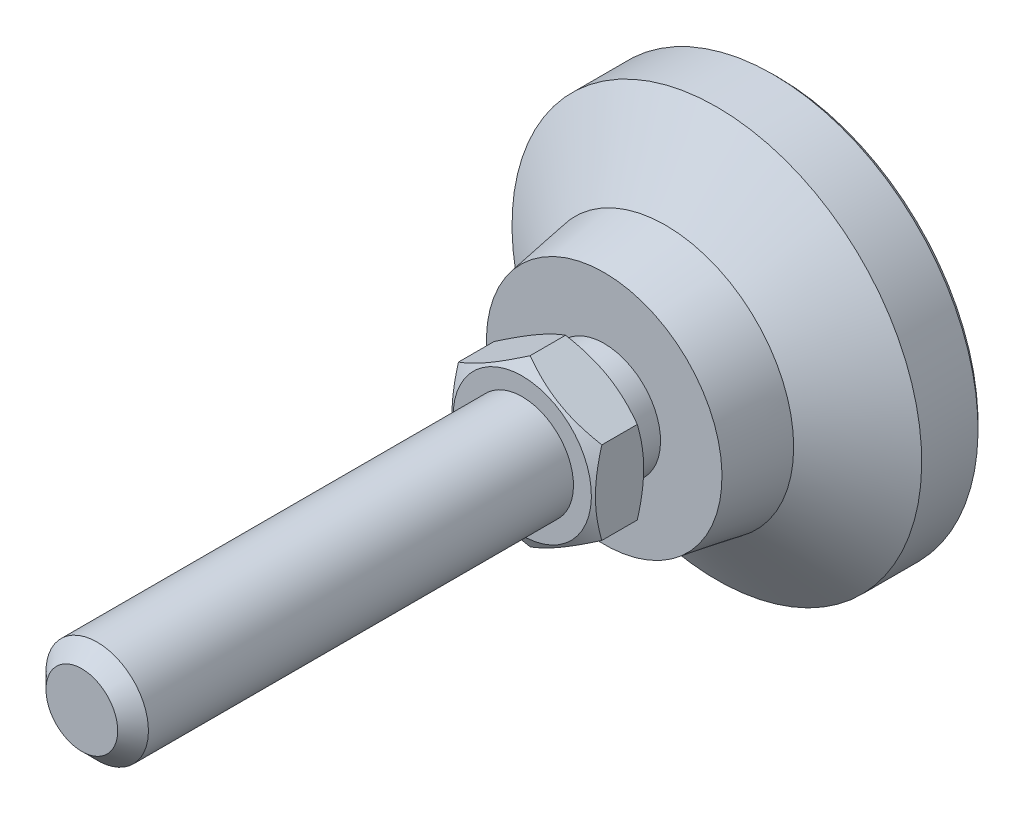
ISO-10303-21;
HEADER;
FILE_DESCRIPTION(('STEP AP214'),'2;1');
FILE_NAME('part.step','',(''),(''),'','','');
FILE_SCHEMA(('AUTOMOTIVE_DESIGN { 1 0 10303 214 1 1 1 1 }'));
ENDSEC;
DATA;
#1=APPLICATION_CONTEXT('core data for automotive mechanical design processes');
#2=APPLICATION_PROTOCOL_DEFINITION('international standard','automotive_design',2000,#1);
#3=PRODUCT_CONTEXT('',#1,'mechanical');
#4=PRODUCT('Part','Part','',(#3));
#5=PRODUCT_RELATED_PRODUCT_CATEGORY('part','',(#4));
#6=PRODUCT_DEFINITION_FORMATION('','',#4);
#7=PRODUCT_DEFINITION_CONTEXT('part definition',#1,'design');
#8=PRODUCT_DEFINITION('design','',#6,#7);
#9=PRODUCT_DEFINITION_SHAPE('','',#8);
#10=(LENGTH_UNIT() NAMED_UNIT(*) SI_UNIT(.MILLI.,.METRE.));
#11=(NAMED_UNIT(*) PLANE_ANGLE_UNIT() SI_UNIT($,.RADIAN.));
#12=(NAMED_UNIT(*) SI_UNIT($,.STERADIAN.) SOLID_ANGLE_UNIT());
#13=UNCERTAINTY_MEASURE_WITH_UNIT(LENGTH_MEASURE(1.E-05),#10,'distance_accuracy_value','');
#14=(GEOMETRIC_REPRESENTATION_CONTEXT(3) GLOBAL_UNCERTAINTY_ASSIGNED_CONTEXT((#13)) GLOBAL_UNIT_ASSIGNED_CONTEXT((#10,
#11,#12)) REPRESENTATION_CONTEXT('',''));
#15=CARTESIAN_POINT('',(0.,0.,0.));
#16=DIRECTION('',(0.,0.,1.));
#17=DIRECTION('',(1.,0.,0.));
#18=AXIS2_PLACEMENT_3D('',#15,#16,#17);
#19=CARTESIAN_POINT('',(-5.49999999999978,0.,20.));
#20=DIRECTION('',(0.,0.,1.));
#21=DIRECTION('',(0.,-1.,0.));
#22=AXIS2_PLACEMENT_3D('',#19,#20,#21);
#23=PLANE('',#22);
#24=CARTESIAN_POINT('',(0.,0.,20.));
#25=DIRECTION('',(0.,0.,-1.));
#26=DIRECTION('',(0.,1.,0.));
#27=AXIS2_PLACEMENT_3D('',#24,#25,#26);
#28=CIRCLE('',#27,5.49999999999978);
#29=CARTESIAN_POINT('',(0.,5.49999999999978,20.));
#30=VERTEX_POINT('',#29);
#31=EDGE_CURVE('E99',#30,#30,#28,.T.);
#32=ORIENTED_EDGE('',*,*,#31,.F.);
#33=EDGE_LOOP('',(#32));
#34=FACE_BOUND('',#33,.T.);
#35=CARTESIAN_POINT('',(0.,0.,20.));
#36=DIRECTION('',(0.,0.,-1.));
#37=DIRECTION('',(0.,1.,0.));
#38=AXIS2_PLACEMENT_3D('',#35,#36,#37);
#39=CIRCLE('',#38,6.75);
#40=CARTESIAN_POINT('',(0.,6.75,20.));
#41=VERTEX_POINT('',#40);
#42=EDGE_CURVE('E79',#41,#41,#39,.T.);
#43=ORIENTED_EDGE('',*,*,#42,.T.);
#44=EDGE_LOOP('',(#43));
#45=FACE_BOUND('',#44,.T.);
#46=ADVANCED_FACE('F14',(#34,#45),#23,.F.);
#47=CARTESIAN_POINT('',(0.,0.,-1.00000000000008));
#48=DIRECTION('',(0.,0.,-1.));
#49=DIRECTION('',(0.,1.,0.));
#50=AXIS2_PLACEMENT_3D('',#47,#48,#49);
#51=CYLINDRICAL_SURFACE('',#50,20.);
#52=CARTESIAN_POINT('',(0.,0.,0.500000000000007));
#53=DIRECTION('',(0.,0.,-1.));
#54=DIRECTION('',(0.,1.,0.));
#55=AXIS2_PLACEMENT_3D('',#52,#53,#54);
#56=CIRCLE('',#55,20.);
#57=CARTESIAN_POINT('',(0.,20.,0.500000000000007));
#58=VERTEX_POINT('',#57);
#59=EDGE_CURVE('E117',#58,#58,#56,.F.);
#60=ORIENTED_EDGE('',*,*,#59,.T.);
#61=EDGE_LOOP('',(#60));
#62=FACE_BOUND('',#61,.T.);
#63=CARTESIAN_POINT('',(0.,0.,6.));
#64=DIRECTION('',(0.,0.,-1.));
#65=DIRECTION('',(0.,1.,0.));
#66=AXIS2_PLACEMENT_3D('',#63,#64,#65);
#67=CIRCLE('',#66,20.);
#68=CARTESIAN_POINT('',(0.,20.,6.));
#69=VERTEX_POINT('',#68);
#70=EDGE_CURVE('E111',#69,#69,#67,.T.);
#71=ORIENTED_EDGE('',*,*,#70,.T.);
#72=EDGE_LOOP('',(#71));
#73=FACE_BOUND('',#72,.T.);
#74=ADVANCED_FACE('F238',(#62,#73),#51,.T.);
#75=CARTESIAN_POINT('',(0.,0.,11.));
#76=DIRECTION('',(0.,0.,-1.));
#77=DIRECTION('',(0.,1.,0.));
#78=AXIS2_PLACEMENT_3D('',#75,#76,#77);
#79=CONICAL_SURFACE('',#78,12.5,0.98279372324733);
#80=ORIENTED_EDGE('',*,*,#70,.F.);
#81=EDGE_LOOP('',(#80));
#82=FACE_BOUND('',#81,.T.);
#83=CARTESIAN_POINT('',(0.,0.,11.));
#84=DIRECTION('',(0.,0.,-1.));
#85=DIRECTION('',(0.,1.,0.));
#86=AXIS2_PLACEMENT_3D('',#83,#84,#85);
#87=CIRCLE('',#86,12.5);
#88=CARTESIAN_POINT('',(0.,12.5,11.));
#89=VERTEX_POINT('',#88);
#90=EDGE_CURVE('E108',#89,#89,#87,.T.);
#91=ORIENTED_EDGE('',*,*,#90,.T.);
#92=EDGE_LOOP('',(#91));
#93=FACE_BOUND('',#92,.T.);
#94=ADVANCED_FACE('F245',(#82,#93),#79,.T.);
#95=CARTESIAN_POINT('',(0.,0.,17.));
#96=DIRECTION('',(0.,0.,-1.));
#97=DIRECTION('',(0.,1.,0.));
#98=AXIS2_PLACEMENT_3D('',#95,#96,#97);
#99=CONICAL_SURFACE('',#98,11.5,0.165148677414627);
#100=ORIENTED_EDGE('',*,*,#90,.F.);
#101=EDGE_LOOP('',(#100));
#102=FACE_BOUND('',#101,.T.);
#103=CARTESIAN_POINT('',(0.,0.,17.));
#104=DIRECTION('',(0.,0.,-1.));
#105=DIRECTION('',(0.,1.,0.));
#106=AXIS2_PLACEMENT_3D('',#103,#104,#105);
#107=CIRCLE('',#106,11.5);
#108=CARTESIAN_POINT('',(0.,11.5,17.));
#109=VERTEX_POINT('',#108);
#110=EDGE_CURVE('E105',#109,#109,#107,.T.);
#111=ORIENTED_EDGE('',*,*,#110,.T.);
#112=EDGE_LOOP('',(#111));
#113=FACE_BOUND('',#112,.T.);
#114=ADVANCED_FACE('F258',(#102,#113),#99,.T.);
#115=CARTESIAN_POINT('',(-11.5,0.,17.));
#116=DIRECTION('',(0.,0.,-1.));
#117=DIRECTION('',(0.,1.,0.));
#118=AXIS2_PLACEMENT_3D('',#115,#116,#117);
#119=PLANE('',#118);
#120=ORIENTED_EDGE('',*,*,#110,.F.);
#121=EDGE_LOOP('',(#120));
#122=FACE_BOUND('',#121,.T.);
#123=CARTESIAN_POINT('',(0.,0.,17.));
#124=DIRECTION('',(0.,0.,-1.));
#125=DIRECTION('',(0.,1.,0.));
#126=AXIS2_PLACEMENT_3D('',#123,#124,#125);
#127=CIRCLE('',#126,5.49999999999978);
#128=CARTESIAN_POINT('',(0.,5.49999999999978,17.));
#129=VERTEX_POINT('',#128);
#130=EDGE_CURVE('E102',#129,#129,#127,.T.);
#131=ORIENTED_EDGE('',*,*,#130,.T.);
#132=EDGE_LOOP('',(#131));
#133=FACE_BOUND('',#132,.T.);
#134=ADVANCED_FACE('F254',(#122,#133),#119,.F.);
#135=CARTESIAN_POINT('',(0.,0.,-1.00000000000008));
#136=DIRECTION('',(0.,0.,-1.));
#137=DIRECTION('',(0.,1.,0.));
#138=AXIS2_PLACEMENT_3D('',#135,#136,#137);
#139=CYLINDRICAL_SURFACE('',#138,5.49999999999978);
#140=ORIENTED_EDGE('',*,*,#130,.F.);
#141=EDGE_LOOP('',(#140));
#142=FACE_BOUND('',#141,.T.);
#143=ORIENTED_EDGE('',*,*,#31,.T.);
#144=EDGE_LOOP('',(#143));
#145=FACE_BOUND('',#144,.T.);
#146=ADVANCED_FACE('F251',(#142,#145),#139,.T.);
#147=CARTESIAN_POINT('',(0.,0.,0.));
#148=DIRECTION('',(0.,0.,-1.));
#149=DIRECTION('',(0.,1.,0.));
#150=AXIS2_PLACEMENT_3D('',#147,#148,#149);
#151=PLANE('',#150);
#152=CARTESIAN_POINT('',(0.,0.,0.));
#153=DIRECTION('',(0.,0.,-1.));
#154=DIRECTION('',(0.,1.,0.));
#155=AXIS2_PLACEMENT_3D('',#152,#153,#154);
#156=CIRCLE('',#155,19.5);
#157=CARTESIAN_POINT('',(0.,19.5,0.));
#158=VERTEX_POINT('',#157);
#159=EDGE_CURVE('E114',#158,#158,#156,.T.);
#160=ORIENTED_EDGE('',*,*,#159,.T.);
#161=EDGE_LOOP('',(#160));
#162=FACE_BOUND('',#161,.T.);
#163=ADVANCED_FACE('F197',(#162),#151,.T.);
#164=CARTESIAN_POINT('',(0.,0.,0.));
#165=DIRECTION('',(0.,0.,1.));
#166=DIRECTION('',(0.,-1.,0.));
#167=AXIS2_PLACEMENT_3D('',#164,#165,#166);
#168=CONICAL_SURFACE('',#167,19.5,0.785398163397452);
#169=ORIENTED_EDGE('',*,*,#59,.F.);
#170=EDGE_LOOP('',(#169));
#171=FACE_BOUND('',#170,.T.);
#172=ORIENTED_EDGE('',*,*,#159,.F.);
#173=EDGE_LOOP('',(#172));
#174=FACE_BOUND('',#173,.T.);
#175=ADVANCED_FACE('F16',(#171,#174),#168,.T.);
#176=CARTESIAN_POINT('',(0.,0.,20.));
#177=DIRECTION('',(0.,0.,1.));
#178=DIRECTION('',(0.,-1.,0.));
#179=AXIS2_PLACEMENT_3D('',#176,#177,#178);
#180=CONICAL_SURFACE('',#179,6.75,1.0471975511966);
#181=CARTESIAN_POINT('',(-7.,10.8286773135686,23.5473523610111));
#182=CARTESIAN_POINT('',(-7.,10.5231670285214,23.3992618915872));
#183=CARTESIAN_POINT('',(-7.,10.2169525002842,23.2525992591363));
#184=CARTESIAN_POINT('',(-7.,9.60274032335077,22.9629332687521));
#185=CARTESIAN_POINT('',(-7.,9.29474240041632,22.8199304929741));
#186=CARTESIAN_POINT('',(-7.,8.67498885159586,22.5376625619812));
#187=CARTESIAN_POINT('',(-7.,8.36322187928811,22.39842223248));
#188=CARTESIAN_POINT('',(-7.,7.73719876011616,22.1256761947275));
#189=CARTESIAN_POINT('',(-7.,7.42294273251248,21.9921702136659));
#190=CARTESIAN_POINT('',(-7.,6.78140506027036,21.7282793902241));
#191=CARTESIAN_POINT('',(-7.,6.45402670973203,21.5981283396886));
#192=CARTESIAN_POINT('',(-7.,5.7954306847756,21.3477424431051));
#193=CARTESIAN_POINT('',(-7.,5.46421258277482,21.2275087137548));
#194=CARTESIAN_POINT('',(-7.,4.79803485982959,21.0001341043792));
#195=CARTESIAN_POINT('',(-7.,4.46308446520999,20.8929664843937));
#196=CARTESIAN_POINT('',(-7.,3.78839128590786,20.6951793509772));
#197=CARTESIAN_POINT('',(-7.,3.44865005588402,20.6045545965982));
#198=CARTESIAN_POINT('',(-7.,2.76600511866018,20.444706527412));
#199=CARTESIAN_POINT('',(-7.,2.42312908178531,20.3753682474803));
#200=CARTESIAN_POINT('',(-7.,1.90571452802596,20.2903413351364));
#201=CARTESIAN_POINT('',(-7.,1.73271335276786,20.2651612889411));
#202=CARTESIAN_POINT('',(-7.,1.38586036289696,20.2216225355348));
#203=CARTESIAN_POINT('',(-7.,1.21200863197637,20.2032631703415));
#204=CARTESIAN_POINT('',(-7.,0.865946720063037,20.1739604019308));
#205=CARTESIAN_POINT('',(-7.,0.693744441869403,20.1629240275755));
#206=CARTESIAN_POINT('',(-7.,0.349027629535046,20.1481413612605));
#207=CARTESIAN_POINT('',(-7.,0.176513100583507,20.1443949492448));
#208=CARTESIAN_POINT('',(-7.,-0.168520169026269,20.1442815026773));
#209=CARTESIAN_POINT('',(-7.,-0.341038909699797,20.1479145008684));
#210=CARTESIAN_POINT('',(-7.,-0.685770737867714,20.1624715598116));
#211=CARTESIAN_POINT('',(-7.,-0.857983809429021,20.1733959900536));
#212=CARTESIAN_POINT('',(-7.,-1.27268968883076,20.2082522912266));
#213=CARTESIAN_POINT('',(-7.,-1.51489399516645,20.2356895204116));
#214=CARTESIAN_POINT('',(-7.,-1.99747569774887,20.3034833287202));
#215=CARTESIAN_POINT('',(-7.,-2.23785283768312,20.3438416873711));
#216=CARTESIAN_POINT('',(-7.,-2.95598505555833,20.4821559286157));
#217=CARTESIAN_POINT('',(-7.,-3.43046706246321,20.5973249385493));
#218=CARTESIAN_POINT('',(-7.,-4.1399103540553,20.7966719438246));
#219=CARTESIAN_POINT('',(-7.,-4.37856066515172,20.8684732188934));
#220=CARTESIAN_POINT('',(-7.,-4.85354269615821,21.0194420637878));
#221=CARTESIAN_POINT('',(-7.,-5.08987440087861,21.0986096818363));
#222=CARTESIAN_POINT('',(-7.,-5.56029534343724,21.263048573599));
#223=CARTESIAN_POINT('',(-7.,-5.79438531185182,21.3483177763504));
#224=CARTESIAN_POINT('',(-7.,-6.26063186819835,21.5239656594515));
#225=CARTESIAN_POINT('',(-7.,-6.49278847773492,21.6143442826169));
#226=CARTESIAN_POINT('',(-7.,-7.03644198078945,21.8317803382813));
#227=CARTESIAN_POINT('',(-7.,-7.34723540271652,21.9605932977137));
#228=CARTESIAN_POINT('',(-7.,-7.9662167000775,22.2243518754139));
#229=CARTESIAN_POINT('',(-7.,-8.27440442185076,22.359297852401));
#230=CARTESIAN_POINT('',(-7.,-8.88864807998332,22.6341025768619));
#231=CARTESIAN_POINT('',(-7.,-9.19470358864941,22.7739622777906));
#232=CARTESIAN_POINT('',(-7.,-9.80498694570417,23.05762087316));
#233=CARTESIAN_POINT('',(-7.,-10.1092147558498,23.2014198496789));
#234=CARTESIAN_POINT('',(-7.,-10.7164491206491,23.4923727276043));
#235=CARTESIAN_POINT('',(-7.,-11.0194540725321,23.6395299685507));
#236=CARTESIAN_POINT('',(-7.,-11.6241664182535,23.9364891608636));
#237=CARTESIAN_POINT('',(-7.,-11.9258738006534,24.0862911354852));
#238=CARTESIAN_POINT('',(-7.,-12.8292793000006,24.5389279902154));
#239=CARTESIAN_POINT('',(-7.,-13.4293394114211,24.8450317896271));
#240=CARTESIAN_POINT('',(-7.,-14.576764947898,25.4378090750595));
#241=CARTESIAN_POINT('',(-7.,-15.1243832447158,25.7239952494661));
#242=CARTESIAN_POINT('',(-7.,-16.2175820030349,26.300275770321));
#243=CARTESIAN_POINT('',(-7.,-16.7631623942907,26.5903702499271));
#244=CARTESIAN_POINT('',(-7.,-17.8514037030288,27.1728297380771));
#245=CARTESIAN_POINT('',(-7.,-18.3940684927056,27.4651875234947));
#246=CARTESIAN_POINT('',(-7.,-19.4780927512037,28.0522447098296));
#247=CARTESIAN_POINT('',(-7.,-20.0194522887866,28.3469439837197));
#248=CARTESIAN_POINT('',(-7.,-20.56033024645,28.6425185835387));
#249=B_SPLINE_CURVE_WITH_KNOTS('',3,(#181,#182,#183,#184,#185,#186,#187,#188,#189,#190,#191,
#192,#193,#194,#195,#196,#197,#198,#199,#200,#201,#202,#203,#204,#205,#206,#207,#208,#209,#210,
#211,#212,#213,#214,#215,#216,#217,#218,#219,#220,#221,#222,#223,#224,#225,#226,#227,#228,#229,
#230,#231,#232,#233,#234,#235,#236,#237,#238,#239,#240,#241,#242,#243,#244,#245,#246,#247,#248),
.UNSPECIFIED.,.F.,.F.,(4,2,2,2,2,2,2,2,2,2,2,2,2,2,2,2,2,2,2,2,2,2,2,2,2,2,2,2,2,2,2,2,2,4),(0.,
1.01854381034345,2.03724864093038,3.0615454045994,4.08579338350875,5.14257124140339,
6.1994679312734,7.25416400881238,8.30852536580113,9.35708780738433,9.8814465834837,
10.4057547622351,10.9232721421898,11.4407809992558,11.9582921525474,12.4758295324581,
13.2066762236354,13.9376236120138,15.4003400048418,16.1479314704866,16.8955278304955,
17.6428716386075,18.3902070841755,19.3994095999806,20.4086712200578,21.4181297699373,
22.427609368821,23.4381407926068,24.4486811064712,26.4694997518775,28.3231535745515,
30.1768707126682,32.0260869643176,33.8752035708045),.UNSPECIFIED.);
#250=CARTESIAN_POINT('',(-7.,4.04145188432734,20.7695523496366));
#251=VERTEX_POINT('',#250);
#252=CARTESIAN_POINT('',(-7.,-4.04145188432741,20.7695523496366));
#253=VERTEX_POINT('',#252);
#254=EDGE_CURVE('E85',#251,#253,#249,.T.);
#255=ORIENTED_EDGE('',*,*,#254,.F.);
#256=CARTESIAN_POINT('',(0.00020000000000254,8.08301923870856,20.7696190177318));
#257=CARTESIAN_POINT('',(-0.153667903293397,7.99418356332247,20.7183374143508));
#258=CARTESIAN_POINT('',(-0.308109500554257,7.90501666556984,20.669383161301));
#259=CARTESIAN_POINT('',(-0.618246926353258,7.725958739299,20.5767703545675));
#260=CARTESIAN_POINT('',(-0.773943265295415,7.63606741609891,20.5331140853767));
#261=CARTESIAN_POINT('',(-1.24352516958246,7.36495417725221,20.4109491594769));
#262=CARTESIAN_POINT('',(-1.5592643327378,7.18266208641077,20.3414631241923));
#263=CARTESIAN_POINT('',(-2.03176224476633,6.90986528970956,20.2599825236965));
#264=CARTESIAN_POINT('',(-2.18710922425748,6.82017566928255,20.2367710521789));
#265=CARTESIAN_POINT('',(-2.49850511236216,6.64039116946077,20.1978487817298));
#266=CARTESIAN_POINT('',(-2.6545539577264,6.55029632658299,20.1821373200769));
#267=CARTESIAN_POINT('',(-2.96692267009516,6.36995016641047,20.1586154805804));
#268=CARTESIAN_POINT('',(-3.12324202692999,6.27969914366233,20.1507961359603));
#269=CARTESIAN_POINT('',(-3.43601650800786,6.09911871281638,20.1432178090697));
#270=CARTESIAN_POINT('',(-3.59247162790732,6.00878930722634,20.1434585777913));
#271=CARTESIAN_POINT('',(-4.02110687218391,5.76131663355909,20.1551972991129));
#272=CARTESIAN_POINT('',(-4.29314668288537,5.6042543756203,20.1749033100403));
#273=CARTESIAN_POINT('',(-4.83541944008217,5.29117305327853,20.2373910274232));
#274=CARTESIAN_POINT('',(-5.10565047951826,5.13515508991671,20.2801940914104));
#275=CARTESIAN_POINT('',(-5.64901454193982,4.82144370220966,20.3871892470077));
#276=CARTESIAN_POINT('',(-5.92207900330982,4.66378986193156,20.4518346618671));
#277=CARTESIAN_POINT('',(-6.46413578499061,4.35083323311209,20.5985536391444));
#278=CARTESIAN_POINT('',(-6.73313504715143,4.19552643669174,20.6805927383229));
#279=CARTESIAN_POINT('',(-7.0002,4.0413364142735,20.7696190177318));
#280=B_SPLINE_CURVE_WITH_KNOTS('',3,(#256,#257,#258,#259,#260,#261,#262,#263,#264,#265,#266,
#267,#268,#269,#270,#271,#272,#273,#274,#275,#276,#277,#278,#279),.UNSPECIFIED.,.F.,.F.,(4,2,2,
2,2,2,2,2,2,2,2,4),(0.,0.554727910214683,1.10969417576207,2.22193274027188,2.76443041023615,
3.30688013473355,3.84871284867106,4.39052882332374,5.33376515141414,6.27787517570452,
7.24292418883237,8.20607866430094),.UNSPECIFIED.);
#281=CARTESIAN_POINT('',(0.,8.08290376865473,20.7695523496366));
#282=VERTEX_POINT('',#281);
#283=EDGE_CURVE('E205',#282,#251,#280,.T.);
#284=ORIENTED_EDGE('',*,*,#283,.F.);
#285=CARTESIAN_POINT('',(7.0002,4.04133641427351,20.7696190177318));
#286=CARTESIAN_POINT('',(6.8463320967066,4.1301720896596,20.7183374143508));
#287=CARTESIAN_POINT('',(6.69189049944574,4.21933898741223,20.669383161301));
#288=CARTESIAN_POINT('',(6.38175307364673,4.39839691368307,20.5767703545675));
#289=CARTESIAN_POINT('',(6.22605673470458,4.48828823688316,20.5331140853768));
#290=CARTESIAN_POINT('',(5.75647483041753,4.75940147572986,20.4109491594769));
#291=CARTESIAN_POINT('',(5.44073566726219,4.9416935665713,20.3414631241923));
#292=CARTESIAN_POINT('',(4.96823775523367,5.21449036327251,20.2599825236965));
#293=CARTESIAN_POINT('',(4.81289077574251,5.30417998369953,20.2367710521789));
#294=CARTESIAN_POINT('',(4.50149488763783,5.4839644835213,20.1978487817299));
#295=CARTESIAN_POINT('',(4.34544604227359,5.57405932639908,20.1821373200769));
#296=CARTESIAN_POINT('',(4.03307732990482,5.7544054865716,20.1586154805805));
#297=CARTESIAN_POINT('',(3.87675797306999,5.84465650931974,20.1507961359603));
#298=CARTESIAN_POINT('',(3.56398349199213,6.02523694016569,20.1432178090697));
#299=CARTESIAN_POINT('',(3.40752837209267,6.11556634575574,20.1434585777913));
#300=CARTESIAN_POINT('',(2.97889312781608,6.36303901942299,20.1551972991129));
#301=CARTESIAN_POINT('',(2.70685331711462,6.52010127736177,20.1749033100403));
#302=CARTESIAN_POINT('',(2.16458055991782,6.83318259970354,20.2373910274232));
#303=CARTESIAN_POINT('',(1.89434952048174,6.98920056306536,20.2801940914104));
#304=CARTESIAN_POINT('',(1.35098545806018,7.30291195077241,20.3871892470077));
#305=CARTESIAN_POINT('',(1.07792099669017,7.46056579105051,20.4518346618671));
#306=CARTESIAN_POINT('',(0.535864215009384,7.77352241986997,20.5985536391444));
#307=CARTESIAN_POINT('',(0.266864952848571,7.92882921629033,20.6805927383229));
#308=CARTESIAN_POINT('',(-0.000199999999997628,8.08301923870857,20.7696190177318));
#309=B_SPLINE_CURVE_WITH_KNOTS('',3,(#285,#286,#287,#288,#289,#290,#291,#292,#293,#294,#295,
#296,#297,#298,#299,#300,#301,#302,#303,#304,#305,#306,#307,#308),.UNSPECIFIED.,.F.,.F.,(4,2,2,
2,2,2,2,2,2,2,2,4),(0.,0.554727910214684,1.10969417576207,2.22193274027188,2.76443041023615,
3.30688013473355,3.84871284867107,4.39052882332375,5.33376515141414,6.27787517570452,
7.24292418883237,8.20607866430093),.UNSPECIFIED.);
#310=CARTESIAN_POINT('',(7.,4.04145188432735,20.7695523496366));
#311=VERTEX_POINT('',#310);
#312=EDGE_CURVE('E212',#311,#282,#309,.T.);
#313=ORIENTED_EDGE('',*,*,#312,.F.);
#314=CARTESIAN_POINT('',(7.,10.8286773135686,23.5473523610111));
#315=CARTESIAN_POINT('',(7.,10.5231670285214,23.3992618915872));
#316=CARTESIAN_POINT('',(7.,10.2169525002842,23.2525992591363));
#317=CARTESIAN_POINT('',(7.,9.60274032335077,22.9629332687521));
#318=CARTESIAN_POINT('',(7.,9.29474240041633,22.8199304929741));
#319=CARTESIAN_POINT('',(7.,8.67498885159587,22.5376625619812));
#320=CARTESIAN_POINT('',(7.,8.36322187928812,22.3984222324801));
#321=CARTESIAN_POINT('',(7.,7.73719876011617,22.1256761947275));
#322=CARTESIAN_POINT('',(7.,7.42294273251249,21.9921702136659));
#323=CARTESIAN_POINT('',(7.,6.78140506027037,21.7282793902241));
#324=CARTESIAN_POINT('',(7.,6.45402670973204,21.5981283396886));
#325=CARTESIAN_POINT('',(7.,5.7954306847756,21.3477424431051));
#326=CARTESIAN_POINT('',(7.,5.46421258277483,21.2275087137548));
#327=CARTESIAN_POINT('',(7.,4.7980348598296,21.0001341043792));
#328=CARTESIAN_POINT('',(7.,4.46308446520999,20.8929664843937));
#329=CARTESIAN_POINT('',(7.,3.78839128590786,20.6951793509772));
#330=CARTESIAN_POINT('',(7.,3.44865005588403,20.6045545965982));
#331=CARTESIAN_POINT('',(7.,2.76600511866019,20.444706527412));
#332=CARTESIAN_POINT('',(7.,2.42312908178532,20.3753682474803));
#333=CARTESIAN_POINT('',(7.,1.90571452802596,20.2903413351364));
#334=CARTESIAN_POINT('',(7.,1.73271335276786,20.2651612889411));
#335=CARTESIAN_POINT('',(7.,1.38586036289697,20.2216225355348));
#336=CARTESIAN_POINT('',(7.,1.21200863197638,20.2032631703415));
#337=CARTESIAN_POINT('',(7.,0.865946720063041,20.1739604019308));
#338=CARTESIAN_POINT('',(7.,0.693744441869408,20.1629240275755));
#339=CARTESIAN_POINT('',(7.,0.34902762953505,20.1481413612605));
#340=CARTESIAN_POINT('',(7.,0.176513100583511,20.1443949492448));
#341=CARTESIAN_POINT('',(7.,-0.168520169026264,20.1442815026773));
#342=CARTESIAN_POINT('',(7.,-0.341038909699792,20.1479145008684));
#343=CARTESIAN_POINT('',(7.,-0.68577073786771,20.1624715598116));
#344=CARTESIAN_POINT('',(7.,-0.857983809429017,20.1733959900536));
#345=CARTESIAN_POINT('',(7.,-1.27268968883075,20.2082522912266));
#346=CARTESIAN_POINT('',(7.,-1.51489399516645,20.2356895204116));
#347=CARTESIAN_POINT('',(7.,-1.99747569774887,20.3034833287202));
#348=CARTESIAN_POINT('',(7.,-2.23785283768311,20.3438416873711));
#349=CARTESIAN_POINT('',(7.,-2.95598505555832,20.4821559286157));
#350=CARTESIAN_POINT('',(7.,-3.43046706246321,20.5973249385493));
#351=CARTESIAN_POINT('',(7.,-4.13991035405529,20.7966719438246));
#352=CARTESIAN_POINT('',(7.,-4.37856066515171,20.8684732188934));
#353=CARTESIAN_POINT('',(7.,-4.85354269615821,21.0194420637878));
#354=CARTESIAN_POINT('',(7.,-5.0898744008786,21.0986096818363));
#355=CARTESIAN_POINT('',(7.,-5.56029534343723,21.263048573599));
#356=CARTESIAN_POINT('',(7.,-5.79438531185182,21.3483177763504));
#357=CARTESIAN_POINT('',(7.,-6.26063186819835,21.5239656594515));
#358=CARTESIAN_POINT('',(7.,-6.4927884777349,21.6143442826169));
#359=CARTESIAN_POINT('',(7.,-7.03644198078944,21.8317803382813));
#360=CARTESIAN_POINT('',(7.,-7.34723540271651,21.9605932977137));
#361=CARTESIAN_POINT('',(7.,-7.96621670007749,22.2243518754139));
#362=CARTESIAN_POINT('',(7.,-8.27440442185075,22.359297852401));
#363=CARTESIAN_POINT('',(7.,-8.88864807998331,22.6341025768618));
#364=CARTESIAN_POINT('',(7.,-9.1947035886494,22.7739622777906));
#365=CARTESIAN_POINT('',(7.,-9.80498694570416,23.05762087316));
#366=CARTESIAN_POINT('',(7.,-10.1092147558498,23.2014198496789));
#367=CARTESIAN_POINT('',(7.,-10.7164491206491,23.4923727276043));
#368=CARTESIAN_POINT('',(7.,-11.0194540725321,23.6395299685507));
#369=CARTESIAN_POINT('',(7.,-11.6241664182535,23.9364891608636));
#370=CARTESIAN_POINT('',(7.,-11.9258738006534,24.0862911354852));
#371=CARTESIAN_POINT('',(7.,-12.8292793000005,24.5389279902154));
#372=CARTESIAN_POINT('',(7.,-13.4293394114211,24.8450317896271));
#373=CARTESIAN_POINT('',(7.,-14.576764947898,25.4378090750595));
#374=CARTESIAN_POINT('',(7.,-15.1243832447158,25.7239952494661));
#375=CARTESIAN_POINT('',(7.,-16.2175820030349,26.300275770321));
#376=CARTESIAN_POINT('',(7.,-16.7631623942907,26.5903702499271));
#377=CARTESIAN_POINT('',(7.,-17.8514037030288,27.1728297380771));
#378=CARTESIAN_POINT('',(7.,-18.3940684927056,27.4651875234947));
#379=CARTESIAN_POINT('',(7.,-19.4780927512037,28.0522447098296));
#380=CARTESIAN_POINT('',(7.,-20.0194522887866,28.3469439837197));
#381=CARTESIAN_POINT('',(7.,-20.56033024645,28.6425185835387));
#382=B_SPLINE_CURVE_WITH_KNOTS('',3,(#314,#315,#316,#317,#318,#319,#320,#321,#322,#323,#324,
#325,#326,#327,#328,#329,#330,#331,#332,#333,#334,#335,#336,#337,#338,#339,#340,#341,#342,#343,
#344,#345,#346,#347,#348,#349,#350,#351,#352,#353,#354,#355,#356,#357,#358,#359,#360,#361,#362,
#363,#364,#365,#366,#367,#368,#369,#370,#371,#372,#373,#374,#375,#376,#377,#378,#379,#380,#381),
.UNSPECIFIED.,.F.,.F.,(4,2,2,2,2,2,2,2,2,2,2,2,2,2,2,2,2,2,2,2,2,2,2,2,2,2,2,2,2,2,2,2,2,4),(0.,
1.01854381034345,2.03724864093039,3.0615454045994,4.08579338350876,5.1425712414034,
6.19946793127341,7.25416400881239,8.30852536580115,9.35708780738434,9.88144658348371,
10.4057547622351,10.9232721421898,11.4407809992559,11.9582921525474,12.4758295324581,
13.2066762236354,13.9376236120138,15.4003400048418,16.1479314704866,16.8955278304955,
17.6428716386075,18.3902070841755,19.3994095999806,20.4086712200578,21.4181297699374,
22.427609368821,23.4381407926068,24.4486811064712,26.4694997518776,28.3231535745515,
30.1768707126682,32.0260869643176,33.8752035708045),.UNSPECIFIED.);
#383=CARTESIAN_POINT('',(7.,-4.04145188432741,20.7695523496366));
#384=VERTEX_POINT('',#383);
#385=EDGE_CURVE('E35',#384,#311,#382,.F.);
#386=ORIENTED_EDGE('',*,*,#385,.F.);
#387=CARTESIAN_POINT('',(-0.000199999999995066,-8.08301923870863,20.7696190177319));
#388=CARTESIAN_POINT('',(0.153667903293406,-7.99418356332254,20.7183374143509));
#389=CARTESIAN_POINT('',(0.308109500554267,-7.90501666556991,20.669383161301));
#390=CARTESIAN_POINT('',(0.618246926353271,-7.72595873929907,20.5767703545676));
#391=CARTESIAN_POINT('',(0.773943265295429,-7.63606741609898,20.5331140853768));
#392=CARTESIAN_POINT('',(1.24352516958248,-7.36495417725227,20.4109491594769));
#393=CARTESIAN_POINT('',(1.55926433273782,-7.18266208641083,20.3414631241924));
#394=CARTESIAN_POINT('',(2.03176224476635,-6.90986528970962,20.2599825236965));
#395=CARTESIAN_POINT('',(2.18710922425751,-6.82017566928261,20.2367710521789));
#396=CARTESIAN_POINT('',(2.49850511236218,-6.64039116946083,20.1978487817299));
#397=CARTESIAN_POINT('',(2.65455395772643,-6.55029632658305,20.1821373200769));
#398=CARTESIAN_POINT('',(2.9669226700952,-6.36995016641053,20.1586154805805));
#399=CARTESIAN_POINT('',(3.12324202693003,-6.27969914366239,20.1507961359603));
#400=CARTESIAN_POINT('',(3.43601650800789,-6.09911871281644,20.1432178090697));
#401=CARTESIAN_POINT('',(3.59247162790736,-6.00878930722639,20.1434585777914));
#402=CARTESIAN_POINT('',(4.02110687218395,-5.76131663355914,20.1551972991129));
#403=CARTESIAN_POINT('',(4.29314668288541,-5.60425437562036,20.1749033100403));
#404=CARTESIAN_POINT('',(4.8354194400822,-5.29117305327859,20.2373910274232));
#405=CARTESIAN_POINT('',(5.10565047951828,-5.13515508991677,20.2801940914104));
#406=CARTESIAN_POINT('',(5.64901454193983,-4.82144370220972,20.3871892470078));
#407=CARTESIAN_POINT('',(5.92207900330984,-4.66378986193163,20.4518346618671));
#408=CARTESIAN_POINT('',(6.46413578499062,-4.35083323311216,20.5985536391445));
#409=CARTESIAN_POINT('',(6.73313504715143,-4.19552643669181,20.680592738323));
#410=CARTESIAN_POINT('',(7.0002,-4.04133641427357,20.7696190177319));
#411=B_SPLINE_CURVE_WITH_KNOTS('',3,(#387,#388,#389,#390,#391,#392,#393,#394,#395,#396,#397,
#398,#399,#400,#401,#402,#403,#404,#405,#406,#407,#408,#409,#410),.UNSPECIFIED.,.F.,.F.,(4,2,2,
2,2,2,2,2,2,2,2,4),(0.,0.554727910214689,1.10969417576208,2.2219327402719,2.76443041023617,
3.30688013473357,3.8487128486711,4.39052882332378,5.33376515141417,6.27787517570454,
7.24292418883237,8.20607866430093),.UNSPECIFIED.);
#412=CARTESIAN_POINT('',(0.,-8.08290376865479,20.7695523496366));
#413=VERTEX_POINT('',#412);
#414=EDGE_CURVE('E72',#413,#384,#411,.T.);
#415=ORIENTED_EDGE('',*,*,#414,.F.);
#416=CARTESIAN_POINT('',(-7.0002,-4.04133641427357,20.7696190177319));
#417=CARTESIAN_POINT('',(-6.8463320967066,-4.13017208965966,20.7183374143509));
#418=CARTESIAN_POINT('',(-6.69189049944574,-4.21933898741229,20.669383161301));
#419=CARTESIAN_POINT('',(-6.38175307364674,-4.39839691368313,20.5767703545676));
#420=CARTESIAN_POINT('',(-6.22605673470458,-4.48828823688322,20.5331140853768));
#421=CARTESIAN_POINT('',(-5.75647483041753,-4.75940147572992,20.4109491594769));
#422=CARTESIAN_POINT('',(-5.44073566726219,-4.94169356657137,20.3414631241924));
#423=CARTESIAN_POINT('',(-4.96823775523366,-5.21449036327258,20.2599825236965));
#424=CARTESIAN_POINT('',(-4.8128907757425,-5.30417998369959,20.2367710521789));
#425=CARTESIAN_POINT('',(-4.50149488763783,-5.48396448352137,20.1978487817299));
#426=CARTESIAN_POINT('',(-4.34544604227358,-5.57405932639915,20.1821373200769));
#427=CARTESIAN_POINT('',(-4.03307732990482,-5.75440548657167,20.1586154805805));
#428=CARTESIAN_POINT('',(-3.87675797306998,-5.84465650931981,20.1507961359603));
#429=CARTESIAN_POINT('',(-3.56398349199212,-6.02523694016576,20.1432178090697));
#430=CARTESIAN_POINT('',(-3.40752837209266,-6.11556634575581,20.1434585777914));
#431=CARTESIAN_POINT('',(-2.97889312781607,-6.36303901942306,20.1551972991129));
#432=CARTESIAN_POINT('',(-2.7068533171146,-6.52010127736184,20.1749033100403));
#433=CARTESIAN_POINT('',(-2.16458055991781,-6.83318259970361,20.2373910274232));
#434=CARTESIAN_POINT('',(-1.89434952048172,-6.98920056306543,20.2801940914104));
#435=CARTESIAN_POINT('',(-1.35098545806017,-7.30291195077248,20.3871892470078));
#436=CARTESIAN_POINT('',(-1.07792099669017,-7.46056579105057,20.4518346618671));
#437=CARTESIAN_POINT('',(-0.535864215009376,-7.77352241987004,20.5985536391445));
#438=CARTESIAN_POINT('',(-0.266864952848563,-7.92882921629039,20.680592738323));
#439=CARTESIAN_POINT('',(0.000200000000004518,-8.08301923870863,20.7696190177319));
#440=B_SPLINE_CURVE_WITH_KNOTS('',3,(#416,#417,#418,#419,#420,#421,#422,#423,#424,#425,#426,
#427,#428,#429,#430,#431,#432,#433,#434,#435,#436,#437,#438,#439),.UNSPECIFIED.,.F.,.F.,(4,2,2,
2,2,2,2,2,2,2,2,4),(0.,0.554727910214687,1.10969417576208,2.22193274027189,2.76443041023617,
3.30688013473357,3.84871284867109,4.39052882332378,5.33376515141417,6.27787517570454,
7.24292418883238,8.20607866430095),.UNSPECIFIED.);
#441=EDGE_CURVE('E75',#253,#413,#440,.T.);
#442=ORIENTED_EDGE('',*,*,#441,.F.);
#443=EDGE_LOOP('',(#255,#284,#313,#386,#415,#442));
#444=FACE_BOUND('',#443,.T.);
#445=ORIENTED_EDGE('',*,*,#42,.F.);
#446=EDGE_LOOP('',(#445));
#447=FACE_BOUND('',#446,.T.);
#448=ADVANCED_FACE('F73',(#444,#447),#180,.T.);
#449=CARTESIAN_POINT('',(-2.79999999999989,0.,68.));
#450=DIRECTION('',(0.,0.,-1.));
#451=DIRECTION('',(0.,1.,0.));
#452=AXIS2_PLACEMENT_3D('',#449,#450,#451);
#453=PLANE('',#452);
#454=CARTESIAN_POINT('',(0.,0.,68.));
#455=DIRECTION('',(0.,0.,-1.));
#456=DIRECTION('',(0.,1.,0.));
#457=AXIS2_PLACEMENT_3D('',#454,#455,#456);
#458=CIRCLE('',#457,3.5);
#459=CARTESIAN_POINT('',(0.,3.5,68.));
#460=VERTEX_POINT('',#459);
#461=EDGE_CURVE('E90',#460,#460,#458,.T.);
#462=ORIENTED_EDGE('',*,*,#461,.F.);
#463=EDGE_LOOP('',(#462));
#464=FACE_BOUND('',#463,.T.);
#465=ADVANCED_FACE('F319',(#464),#453,.F.);
#466=CARTESIAN_POINT('',(0.,0.,68.));
#467=DIRECTION('',(0.,0.,-1.));
#468=DIRECTION('',(0.,1.,0.));
#469=AXIS2_PLACEMENT_3D('',#466,#467,#468);
#470=CONICAL_SURFACE('',#469,3.5,0.785398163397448);
#471=CARTESIAN_POINT('',(0.,0.,66.5));
#472=DIRECTION('',(0.,0.,-1.));
#473=DIRECTION('',(0.,1.,0.));
#474=AXIS2_PLACEMENT_3D('',#471,#472,#473);
#475=CIRCLE('',#474,5.);
#476=CARTESIAN_POINT('',(0.,5.,66.5));
#477=VERTEX_POINT('',#476);
#478=EDGE_CURVE('E95',#477,#477,#475,.T.);
#479=ORIENTED_EDGE('',*,*,#478,.F.);
#480=EDGE_LOOP('',(#479));
#481=FACE_BOUND('',#480,.T.);
#482=ORIENTED_EDGE('',*,*,#461,.T.);
#483=EDGE_LOOP('',(#482));
#484=FACE_BOUND('',#483,.T.);
#485=ADVANCED_FACE('F326',(#481,#484),#470,.T.);
#486=CARTESIAN_POINT('',(0.,0.,-4.35897435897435));
#487=DIRECTION('',(0.,0.,-1.));
#488=DIRECTION('',(0.,1.,0.));
#489=AXIS2_PLACEMENT_3D('',#486,#487,#488);
#490=CYLINDRICAL_SURFACE('',#489,5.);
#491=CARTESIAN_POINT('',(0.,0.,25.));
#492=DIRECTION('',(0.,0.,-1.));
#493=DIRECTION('',(0.,1.,0.));
#494=AXIS2_PLACEMENT_3D('',#491,#492,#493);
#495=CIRCLE('',#494,5.);
#496=CARTESIAN_POINT('',(0.,5.,25.));
#497=VERTEX_POINT('',#496);
#498=EDGE_CURVE('E28',#497,#497,#495,.F.);
#499=ORIENTED_EDGE('',*,*,#498,.T.);
#500=EDGE_LOOP('',(#499));
#501=FACE_BOUND('',#500,.T.);
#502=ORIENTED_EDGE('',*,*,#478,.T.);
#503=EDGE_LOOP('',(#502));
#504=FACE_BOUND('',#503,.T.);
#505=ADVANCED_FACE('F122',(#501,#504),#490,.T.);
#506=CARTESIAN_POINT('',(-3.99999999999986,0.,25.));
#507=DIRECTION('',(0.,0.,-1.));
#508=DIRECTION('',(0.,1.,0.));
#509=AXIS2_PLACEMENT_3D('',#506,#507,#508);
#510=PLANE('',#509);
#511=ORIENTED_EDGE('',*,*,#498,.F.);
#512=EDGE_LOOP('',(#511));
#513=FACE_BOUND('',#512,.T.);
#514=CARTESIAN_POINT('',(0.,0.,25.));
#515=DIRECTION('',(0.,0.,-1.));
#516=DIRECTION('',(0.,1.,0.));
#517=AXIS2_PLACEMENT_3D('',#514,#515,#516);
#518=CIRCLE('',#517,6.75);
#519=CARTESIAN_POINT('',(0.,6.75,25.));
#520=VERTEX_POINT('',#519);
#521=EDGE_CURVE('E84',#520,#520,#518,.T.);
#522=ORIENTED_EDGE('',*,*,#521,.F.);
#523=EDGE_LOOP('',(#522));
#524=FACE_BOUND('',#523,.T.);
#525=ADVANCED_FACE('F125',(#513,#524),#510,.F.);
#526=CARTESIAN_POINT('',(0.,0.,23.2947625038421));
#527=DIRECTION('',(0.,0.,-1.));
#528=DIRECTION('',(0.,1.,0.));
#529=AXIS2_PLACEMENT_3D('',#526,#527,#528);
#530=CONICAL_SURFACE('',#529,9.70355798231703,1.0471975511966);
#531=CARTESIAN_POINT('',(7.0002,-4.04133641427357,24.230380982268));
#532=CARTESIAN_POINT('',(6.84633209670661,-4.13017208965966,24.281662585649));
#533=CARTESIAN_POINT('',(6.69189049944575,-4.21933898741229,24.3306168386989));
#534=CARTESIAN_POINT('',(6.38175307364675,-4.39839691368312,24.4232296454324));
#535=CARTESIAN_POINT('',(6.22605673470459,-4.48828823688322,24.4668859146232));
#536=CARTESIAN_POINT('',(5.75647483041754,-4.75940147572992,24.589050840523));
#537=CARTESIAN_POINT('',(5.4407356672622,-4.94169356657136,24.6585368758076));
#538=CARTESIAN_POINT('',(4.96823775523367,-5.21449036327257,24.7400174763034));
#539=CARTESIAN_POINT('',(4.81289077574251,-5.30417998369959,24.7632289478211));
#540=CARTESIAN_POINT('',(4.50149488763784,-5.48396448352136,24.8021512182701));
#541=CARTESIAN_POINT('',(4.34544604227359,-5.57405932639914,24.817862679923));
#542=CARTESIAN_POINT('',(4.03307732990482,-5.75440548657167,24.8413845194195));
#543=CARTESIAN_POINT('',(3.87675797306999,-5.84465650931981,24.8492038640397));
#544=CARTESIAN_POINT('',(3.56398349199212,-6.02523694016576,24.8567821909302));
#545=CARTESIAN_POINT('',(3.40752837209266,-6.11556634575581,24.8565414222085));
#546=CARTESIAN_POINT('',(2.97889312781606,-6.36303901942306,24.8448027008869));
#547=CARTESIAN_POINT('',(2.70685331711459,-6.52010127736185,24.8250966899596));
#548=CARTESIAN_POINT('',(2.1645805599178,-6.83318259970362,24.7626089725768));
#549=CARTESIAN_POINT('',(1.89434952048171,-6.98920056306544,24.7198059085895));
#550=CARTESIAN_POINT('',(1.35098545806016,-7.30291195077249,24.6128107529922));
#551=CARTESIAN_POINT('',(1.07792099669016,-7.46056579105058,24.5481653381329));
#552=CARTESIAN_POINT('',(0.535864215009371,-7.77352241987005,24.4014463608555));
#553=CARTESIAN_POINT('',(0.266864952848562,-7.9288292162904,24.319407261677));
#554=CARTESIAN_POINT('',(-0.000199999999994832,-8.08301923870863,24.230380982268));
#555=B_SPLINE_CURVE_WITH_KNOTS('',3,(#531,#532,#533,#534,#535,#536,#537,#538,#539,#540,#541,
#542,#543,#544,#545,#546,#547,#548,#549,#550,#551,#552,#553,#554),.UNSPECIFIED.,.F.,.F.,(4,2,2,
2,2,2,2,2,2,2,2,4),(0.,0.554727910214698,1.1096941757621,2.22193274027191,2.76443041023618,
3.30688013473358,3.84871284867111,4.39052882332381,5.3337651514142,6.27787517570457,
7.24292418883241,8.20607866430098),.UNSPECIFIED.);
#556=CARTESIAN_POINT('',(7.,-4.04145188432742,24.2304476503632));
#557=VERTEX_POINT('',#556);
#558=CARTESIAN_POINT('',(0.,-8.08290376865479,24.2304476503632));
#559=VERTEX_POINT('',#558);
#560=EDGE_CURVE('E9',#557,#559,#555,.T.);
#561=ORIENTED_EDGE('',*,*,#560,.F.);
#562=CARTESIAN_POINT('',(7.,10.8286773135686,21.4526476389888));
#563=CARTESIAN_POINT('',(7.,10.5231670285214,21.6007381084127));
#564=CARTESIAN_POINT('',(7.,10.2169525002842,21.7474007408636));
#565=CARTESIAN_POINT('',(7.,9.60274032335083,22.0370667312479));
#566=CARTESIAN_POINT('',(7.,9.29474240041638,22.1800695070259));
#567=CARTESIAN_POINT('',(7.,8.67498885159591,22.4623374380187));
#568=CARTESIAN_POINT('',(7.,8.36322187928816,22.6015777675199));
#569=CARTESIAN_POINT('',(7.,7.73719876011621,22.8743238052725));
#570=CARTESIAN_POINT('',(7.,7.42294273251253,23.007829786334));
#571=CARTESIAN_POINT('',(7.,6.78140506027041,23.2717206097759));
#572=CARTESIAN_POINT('',(7.,6.45402670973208,23.4018716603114));
#573=CARTESIAN_POINT('',(7.,5.79543068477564,23.6522575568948));
#574=CARTESIAN_POINT('',(7.,5.46421258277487,23.7724912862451));
#575=CARTESIAN_POINT('',(7.,4.79803485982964,23.9998658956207));
#576=CARTESIAN_POINT('',(7.,4.46308446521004,24.1070335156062));
#577=CARTESIAN_POINT('',(7.,3.78839128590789,24.3048206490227));
#578=CARTESIAN_POINT('',(7.,3.44865005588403,24.3954454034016));
#579=CARTESIAN_POINT('',(7.,2.76600511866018,24.5552934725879));
#580=CARTESIAN_POINT('',(7.,2.42312908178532,24.6246317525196));
#581=CARTESIAN_POINT('',(7.,1.90571452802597,24.7096586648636));
#582=CARTESIAN_POINT('',(7.,1.73271335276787,24.7348387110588));
#583=CARTESIAN_POINT('',(7.,1.38586036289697,24.7783774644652));
#584=CARTESIAN_POINT('',(7.,1.21200863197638,24.7967368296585));
#585=CARTESIAN_POINT('',(7.,0.865946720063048,24.8260395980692));
#586=CARTESIAN_POINT('',(7.,0.693744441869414,24.8370759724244));
#587=CARTESIAN_POINT('',(7.,0.349027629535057,24.8518586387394));
#588=CARTESIAN_POINT('',(7.,0.176513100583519,24.8556050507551));
#589=CARTESIAN_POINT('',(7.,-0.168520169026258,24.8557184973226));
#590=CARTESIAN_POINT('',(7.,-0.341038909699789,24.8520854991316));
#591=CARTESIAN_POINT('',(7.,-0.685770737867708,24.8375284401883));
#592=CARTESIAN_POINT('',(7.,-0.857983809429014,24.8266040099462));
#593=CARTESIAN_POINT('',(7.,-1.27268968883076,24.7917477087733));
#594=CARTESIAN_POINT('',(7.,-1.51489399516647,24.7643104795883));
#595=CARTESIAN_POINT('',(7.,-1.9974756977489,24.6965166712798));
#596=CARTESIAN_POINT('',(7.,-2.23785283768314,24.6561583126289));
#597=CARTESIAN_POINT('',(7.,-2.95598505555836,24.5178440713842));
#598=CARTESIAN_POINT('',(7.,-3.43046706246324,24.4026750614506));
#599=CARTESIAN_POINT('',(7.,-4.13991035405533,24.2033280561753));
#600=CARTESIAN_POINT('',(7.,-4.37856066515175,24.1315267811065));
#601=CARTESIAN_POINT('',(7.,-4.85354269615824,23.9805579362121));
#602=CARTESIAN_POINT('',(7.,-5.08987440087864,23.9013903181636));
#603=CARTESIAN_POINT('',(7.,-5.56029534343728,23.736951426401));
#604=CARTESIAN_POINT('',(7.,-5.79438531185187,23.6516822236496));
#605=CARTESIAN_POINT('',(7.,-6.26063186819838,23.4760343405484));
#606=CARTESIAN_POINT('',(7.,-6.49278847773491,23.3856557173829));
#607=CARTESIAN_POINT('',(7.,-7.03644198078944,23.1682196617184));
#608=CARTESIAN_POINT('',(7.,-7.34723540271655,23.0394067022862));
#609=CARTESIAN_POINT('',(7.,-7.96621670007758,22.7756481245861));
#610=CARTESIAN_POINT('',(7.,-8.27440442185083,22.6407021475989));
#611=CARTESIAN_POINT('',(7.,-8.88864807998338,22.3658974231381));
#612=CARTESIAN_POINT('',(7.,-9.19470358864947,22.2260377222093));
#613=CARTESIAN_POINT('',(7.,-9.80498694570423,21.94237912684));
#614=CARTESIAN_POINT('',(7.,-10.1092147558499,21.798580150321));
#615=CARTESIAN_POINT('',(7.,-10.7164491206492,21.5076272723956));
#616=CARTESIAN_POINT('',(7.,-11.0194540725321,21.3604700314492));
#617=CARTESIAN_POINT('',(7.,-11.6241664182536,21.0635108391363));
#618=CARTESIAN_POINT('',(7.,-11.9258738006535,20.9137088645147));
#619=CARTESIAN_POINT('',(7.,-12.8292793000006,20.4610720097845));
#620=CARTESIAN_POINT('',(7.,-13.4293394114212,20.1549682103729));
#621=CARTESIAN_POINT('',(7.,-14.5767649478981,19.5621909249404));
#622=CARTESIAN_POINT('',(7.,-15.1243832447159,19.2760047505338));
#623=CARTESIAN_POINT('',(7.,-16.2175820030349,18.699724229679));
#624=CARTESIAN_POINT('',(7.,-16.7631623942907,18.4096297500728));
#625=CARTESIAN_POINT('',(7.,-17.8514037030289,17.8271702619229));
#626=CARTESIAN_POINT('',(7.,-18.3940684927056,17.5348124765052));
#627=CARTESIAN_POINT('',(7.,-19.4780927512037,16.9477552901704));
#628=CARTESIAN_POINT('',(7.,-20.0194522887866,16.6530560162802));
#629=CARTESIAN_POINT('',(7.,-20.56033024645,16.3574814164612));
#630=B_SPLINE_CURVE_WITH_KNOTS('',3,(#562,#563,#564,#565,#566,#567,#568,#569,#570,#571,#572,
#573,#574,#575,#576,#577,#578,#579,#580,#581,#582,#583,#584,#585,#586,#587,#588,#589,#590,#591,
#592,#593,#594,#595,#596,#597,#598,#599,#600,#601,#602,#603,#604,#605,#606,#607,#608,#609,#610,
#611,#612,#613,#614,#615,#616,#617,#618,#619,#620,#621,#622,#623,#624,#625,#626,#627,#628,#629),
.UNSPECIFIED.,.F.,.F.,(4,2,2,2,2,2,2,2,2,2,2,2,2,2,2,2,2,2,2,2,2,2,2,2,2,2,2,2,2,2,2,2,2,4),(0.,
1.01854381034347,2.03724864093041,3.06154540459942,4.08579338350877,5.14257124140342,
6.19946793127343,7.25416400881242,8.30852536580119,9.3570878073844,9.88144658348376,
10.4057547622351,10.9232721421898,11.4407809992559,11.9582921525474,12.4758295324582,
13.2066762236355,13.9376236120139,15.4003400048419,16.1479314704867,16.8955278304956,
17.6428716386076,18.3902070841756,19.3994095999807,20.4086712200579,21.4181297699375,
22.4276093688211,23.438140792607,24.4486811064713,26.4694997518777,28.3231535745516,
30.1768707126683,32.0260869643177,33.8752035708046),.UNSPECIFIED.);
#631=CARTESIAN_POINT('',(7.,4.04145188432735,24.2304476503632));
#632=VERTEX_POINT('',#631);
#633=EDGE_CURVE('E133',#632,#557,#630,.T.);
#634=ORIENTED_EDGE('',*,*,#633,.F.);
#635=CARTESIAN_POINT('',(-0.000199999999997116,8.08301923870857,24.2303809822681));
#636=CARTESIAN_POINT('',(0.153667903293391,7.99418356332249,24.2816625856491));
#637=CARTESIAN_POINT('',(0.308109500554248,7.90501666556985,24.330616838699));
#638=CARTESIAN_POINT('',(0.61824692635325,7.72595873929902,24.4232296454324));
#639=CARTESIAN_POINT('',(0.773943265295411,7.63606741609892,24.4668859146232));
#640=CARTESIAN_POINT('',(1.24352516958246,7.36495417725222,24.5890508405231));
#641=CARTESIAN_POINT('',(1.55926433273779,7.18266208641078,24.6585368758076));
#642=CARTESIAN_POINT('',(2.03176224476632,6.90986528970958,24.7400174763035));
#643=CARTESIAN_POINT('',(2.18710922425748,6.82017566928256,24.7632289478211));
#644=CARTESIAN_POINT('',(2.49850511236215,6.64039116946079,24.8021512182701));
#645=CARTESIAN_POINT('',(2.6545539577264,6.55029632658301,24.817862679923));
#646=CARTESIAN_POINT('',(2.96692267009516,6.36995016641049,24.8413845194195));
#647=CARTESIAN_POINT('',(3.12324202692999,6.27969914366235,24.8492038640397));
#648=CARTESIAN_POINT('',(3.43601650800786,6.09911871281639,24.8567821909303));
#649=CARTESIAN_POINT('',(3.59247162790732,6.00878930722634,24.8565414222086));
#650=CARTESIAN_POINT('',(4.02110687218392,5.76131663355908,24.8448027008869));
#651=CARTESIAN_POINT('',(4.29314668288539,5.6042543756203,24.8250966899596));
#652=CARTESIAN_POINT('',(4.83541944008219,5.29117305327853,24.7626089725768));
#653=CARTESIAN_POINT('',(5.10565047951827,5.13515508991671,24.7198059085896));
#654=CARTESIAN_POINT('',(5.64901454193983,4.82144370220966,24.6128107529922));
#655=CARTESIAN_POINT('',(5.92207900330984,4.66378986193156,24.5481653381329));
#656=CARTESIAN_POINT('',(6.46413578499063,4.3508332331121,24.4014463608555));
#657=CARTESIAN_POINT('',(6.73313504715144,4.19552643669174,24.319407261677));
#658=CARTESIAN_POINT('',(7.0002,4.04133641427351,24.2303809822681));
#659=B_SPLINE_CURVE_WITH_KNOTS('',3,(#635,#636,#637,#638,#639,#640,#641,#642,#643,#644,#645,
#646,#647,#648,#649,#650,#651,#652,#653,#654,#655,#656,#657,#658),.UNSPECIFIED.,.F.,.F.,(4,2,2,
2,2,2,2,2,2,2,2,4),(0.,0.554727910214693,1.10969417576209,2.22193274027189,2.76443041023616,
3.30688013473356,3.84871284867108,4.39052882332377,5.33376515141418,6.27787517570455,
7.2429241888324,8.20607866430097),.UNSPECIFIED.);
#660=CARTESIAN_POINT('',(0.,8.08290376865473,24.2304476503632));
#661=VERTEX_POINT('',#660);
#662=EDGE_CURVE('E136',#661,#632,#659,.T.);
#663=ORIENTED_EDGE('',*,*,#662,.F.);
#664=CARTESIAN_POINT('',(-7.0002,4.0413364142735,24.2303809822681));
#665=CARTESIAN_POINT('',(-6.84633209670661,4.13017208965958,24.2816625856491));
#666=CARTESIAN_POINT('',(-6.69189049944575,4.21933898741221,24.330616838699));
#667=CARTESIAN_POINT('',(-6.38175307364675,4.39839691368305,24.4232296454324));
#668=CARTESIAN_POINT('',(-6.22605673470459,4.48828823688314,24.4668859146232));
#669=CARTESIAN_POINT('',(-5.75647483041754,4.75940147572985,24.5890508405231));
#670=CARTESIAN_POINT('',(-5.44073566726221,4.94169356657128,24.6585368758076));
#671=CARTESIAN_POINT('',(-4.96823775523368,5.21449036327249,24.7400174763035));
#672=CARTESIAN_POINT('',(-4.81289077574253,5.3041799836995,24.7632289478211));
#673=CARTESIAN_POINT('',(-4.50149488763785,5.48396448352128,24.8021512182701));
#674=CARTESIAN_POINT('',(-4.34544604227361,5.57405932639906,24.817862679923));
#675=CARTESIAN_POINT('',(-4.03307732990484,5.75440548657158,24.8413845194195));
#676=CARTESIAN_POINT('',(-3.87675797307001,5.84465650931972,24.8492038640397));
#677=CARTESIAN_POINT('',(-3.56398349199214,6.02523694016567,24.8567821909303));
#678=CARTESIAN_POINT('',(-3.40752837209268,6.11556634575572,24.8565414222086));
#679=CARTESIAN_POINT('',(-2.97889312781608,6.36303901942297,24.8448027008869));
#680=CARTESIAN_POINT('',(-2.70685331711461,6.52010127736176,24.8250966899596));
#681=CARTESIAN_POINT('',(-2.16458055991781,6.83318259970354,24.7626089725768));
#682=CARTESIAN_POINT('',(-1.89434952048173,6.98920056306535,24.7198059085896));
#683=CARTESIAN_POINT('',(-1.35098545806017,7.30291195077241,24.6128107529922));
#684=CARTESIAN_POINT('',(-1.07792099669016,7.4605657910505,24.5481653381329));
#685=CARTESIAN_POINT('',(-0.535864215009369,7.77352241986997,24.4014463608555));
#686=CARTESIAN_POINT('',(-0.266864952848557,7.92882921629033,24.319407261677));
#687=CARTESIAN_POINT('',(0.00020000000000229,8.08301923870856,24.2303809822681));
#688=B_SPLINE_CURVE_WITH_KNOTS('',3,(#664,#665,#666,#667,#668,#669,#670,#671,#672,#673,#674,
#675,#676,#677,#678,#679,#680,#681,#682,#683,#684,#685,#686,#687),.UNSPECIFIED.,.F.,.F.,(4,2,2,
2,2,2,2,2,2,2,2,4),(0.,0.554727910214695,1.10969417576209,2.22193274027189,2.76443041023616,
3.30688013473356,3.84871284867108,4.39052882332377,5.33376515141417,6.27787517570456,
7.2429241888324,8.20607866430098),.UNSPECIFIED.);
#689=CARTESIAN_POINT('',(-7.,4.04145188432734,24.2304476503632));
#690=VERTEX_POINT('',#689);
#691=EDGE_CURVE('E171',#690,#661,#688,.T.);
#692=ORIENTED_EDGE('',*,*,#691,.F.);
#693=CARTESIAN_POINT('',(-7.,10.8286773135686,21.4526476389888));
#694=CARTESIAN_POINT('',(-7.,10.5231670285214,21.6007381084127));
#695=CARTESIAN_POINT('',(-7.,10.2169525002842,21.7474007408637));
#696=CARTESIAN_POINT('',(-7.,9.60274032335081,22.0370667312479));
#697=CARTESIAN_POINT('',(-7.,9.29474240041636,22.1800695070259));
#698=CARTESIAN_POINT('',(-7.,8.6749888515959,22.4623374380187));
#699=CARTESIAN_POINT('',(-7.,8.36322187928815,22.6015777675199));
#700=CARTESIAN_POINT('',(-7.,7.73719876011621,22.8743238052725));
#701=CARTESIAN_POINT('',(-7.,7.42294273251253,23.007829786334));
#702=CARTESIAN_POINT('',(-7.,6.78140506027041,23.2717206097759));
#703=CARTESIAN_POINT('',(-7.,6.45402670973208,23.4018716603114));
#704=CARTESIAN_POINT('',(-7.,5.79543068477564,23.6522575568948));
#705=CARTESIAN_POINT('',(-7.,5.46421258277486,23.7724912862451));
#706=CARTESIAN_POINT('',(-7.,4.79803485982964,23.9998658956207));
#707=CARTESIAN_POINT('',(-7.,4.46308446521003,24.1070335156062));
#708=CARTESIAN_POINT('',(-7.,3.78839128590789,24.3048206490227));
#709=CARTESIAN_POINT('',(-7.,3.44865005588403,24.3954454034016));
#710=CARTESIAN_POINT('',(-7.,2.76600511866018,24.5552934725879));
#711=CARTESIAN_POINT('',(-7.,2.42312908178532,24.6246317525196));
#712=CARTESIAN_POINT('',(-7.,1.90571452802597,24.7096586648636));
#713=CARTESIAN_POINT('',(-7.,1.73271335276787,24.7348387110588));
#714=CARTESIAN_POINT('',(-7.,1.38586036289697,24.7783774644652));
#715=CARTESIAN_POINT('',(-7.,1.21200863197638,24.7967368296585));
#716=CARTESIAN_POINT('',(-7.,0.865946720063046,24.8260395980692));
#717=CARTESIAN_POINT('',(-7.,0.693744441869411,24.8370759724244));
#718=CARTESIAN_POINT('',(-7.,0.349027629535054,24.8518586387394));
#719=CARTESIAN_POINT('',(-7.,0.176513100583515,24.8556050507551));
#720=CARTESIAN_POINT('',(-7.,-0.168520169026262,24.8557184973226));
#721=CARTESIAN_POINT('',(-7.,-0.341038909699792,24.8520854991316));
#722=CARTESIAN_POINT('',(-7.,-0.68577073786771,24.8375284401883));
#723=CARTESIAN_POINT('',(-7.,-0.857983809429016,24.8266040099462));
#724=CARTESIAN_POINT('',(-7.,-1.27268968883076,24.7917477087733));
#725=CARTESIAN_POINT('',(-7.,-1.51489399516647,24.7643104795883));
#726=CARTESIAN_POINT('',(-7.,-1.9974756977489,24.6965166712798));
#727=CARTESIAN_POINT('',(-7.,-2.23785283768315,24.6561583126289));
#728=CARTESIAN_POINT('',(-7.,-2.95598505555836,24.5178440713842));
#729=CARTESIAN_POINT('',(-7.,-3.43046706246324,24.4026750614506));
#730=CARTESIAN_POINT('',(-7.,-4.13991035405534,24.2033280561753));
#731=CARTESIAN_POINT('',(-7.,-4.37856066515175,24.1315267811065));
#732=CARTESIAN_POINT('',(-7.,-4.85354269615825,23.9805579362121));
#733=CARTESIAN_POINT('',(-7.,-5.08987440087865,23.9013903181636));
#734=CARTESIAN_POINT('',(-7.,-5.56029534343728,23.736951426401));
#735=CARTESIAN_POINT('',(-7.,-5.79438531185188,23.6516822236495));
#736=CARTESIAN_POINT('',(-7.,-6.26063186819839,23.4760343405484));
#737=CARTESIAN_POINT('',(-7.,-6.49278847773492,23.3856557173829));
#738=CARTESIAN_POINT('',(-7.,-7.03644198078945,23.1682196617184));
#739=CARTESIAN_POINT('',(-7.,-7.34723540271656,23.0394067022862));
#740=CARTESIAN_POINT('',(-7.,-7.96621670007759,22.7756481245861));
#741=CARTESIAN_POINT('',(-7.,-8.27440442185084,22.6407021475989));
#742=CARTESIAN_POINT('',(-7.,-8.88864807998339,22.3658974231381));
#743=CARTESIAN_POINT('',(-7.,-9.19470358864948,22.2260377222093));
#744=CARTESIAN_POINT('',(-7.,-9.80498694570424,21.94237912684));
#745=CARTESIAN_POINT('',(-7.,-10.1092147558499,21.798580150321));
#746=CARTESIAN_POINT('',(-7.,-10.7164491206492,21.5076272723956));
#747=CARTESIAN_POINT('',(-7.,-11.0194540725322,21.3604700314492));
#748=CARTESIAN_POINT('',(-7.,-11.6241664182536,21.0635108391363));
#749=CARTESIAN_POINT('',(-7.,-11.9258738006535,20.9137088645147));
#750=CARTESIAN_POINT('',(-7.,-12.8292793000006,20.4610720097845));
#751=CARTESIAN_POINT('',(-7.,-13.4293394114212,20.1549682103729));
#752=CARTESIAN_POINT('',(-7.,-14.5767649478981,19.5621909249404));
#753=CARTESIAN_POINT('',(-7.,-15.1243832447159,19.2760047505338));
#754=CARTESIAN_POINT('',(-7.,-16.2175820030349,18.699724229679));
#755=CARTESIAN_POINT('',(-7.,-16.7631623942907,18.4096297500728));
#756=CARTESIAN_POINT('',(-7.,-17.8514037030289,17.8271702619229));
#757=CARTESIAN_POINT('',(-7.,-18.3940684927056,17.5348124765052));
#758=CARTESIAN_POINT('',(-7.,-19.4780927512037,16.9477552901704));
#759=CARTESIAN_POINT('',(-7.,-20.0194522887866,16.6530560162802));
#760=CARTESIAN_POINT('',(-7.,-20.56033024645,16.3574814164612));
#761=B_SPLINE_CURVE_WITH_KNOTS('',3,(#693,#694,#695,#696,#697,#698,#699,#700,#701,#702,#703,
#704,#705,#706,#707,#708,#709,#710,#711,#712,#713,#714,#715,#716,#717,#718,#719,#720,#721,#722,
#723,#724,#725,#726,#727,#728,#729,#730,#731,#732,#733,#734,#735,#736,#737,#738,#739,#740,#741,
#742,#743,#744,#745,#746,#747,#748,#749,#750,#751,#752,#753,#754,#755,#756,#757,#758,#759,#760),
.UNSPECIFIED.,.F.,.F.,(4,2,2,2,2,2,2,2,2,2,2,2,2,2,2,2,2,2,2,2,2,2,2,2,2,2,2,2,2,2,2,2,2,4),(0.,
1.01854381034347,2.03724864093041,3.06154540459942,4.08579338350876,5.14257124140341,
6.19946793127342,7.2541640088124,8.30852536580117,9.35708780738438,9.88144658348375,
10.4057547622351,10.9232721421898,11.4407809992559,11.9582921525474,12.4758295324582,
13.2066762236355,13.9376236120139,15.4003400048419,16.1479314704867,16.8955278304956,
17.6428716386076,18.3902070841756,19.3994095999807,20.4086712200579,21.4181297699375,
22.4276093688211,23.4381407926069,24.4486811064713,26.4694997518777,28.3231535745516,
30.1768707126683,32.0260869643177,33.8752035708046),.UNSPECIFIED.);
#762=CARTESIAN_POINT('',(-7.,-4.04145188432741,24.2304476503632));
#763=VERTEX_POINT('',#762);
#764=EDGE_CURVE('E178',#763,#690,#761,.F.);
#765=ORIENTED_EDGE('',*,*,#764,.F.);
#766=CARTESIAN_POINT('',(0.000200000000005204,-8.08301923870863,24.230380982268));
#767=CARTESIAN_POINT('',(-0.153667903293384,-7.99418356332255,24.281662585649));
#768=CARTESIAN_POINT('',(-0.308109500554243,-7.90501666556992,24.3306168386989));
#769=CARTESIAN_POINT('',(-0.618246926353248,-7.72595873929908,24.4232296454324));
#770=CARTESIAN_POINT('',(-0.773943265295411,-7.63606741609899,24.4668859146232));
#771=CARTESIAN_POINT('',(-1.24352516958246,-7.36495417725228,24.589050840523));
#772=CARTESIAN_POINT('',(-1.5592643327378,-7.18266208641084,24.6585368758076));
#773=CARTESIAN_POINT('',(-2.03176224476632,-6.90986528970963,24.7400174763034));
#774=CARTESIAN_POINT('',(-2.18710922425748,-6.82017566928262,24.7632289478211));
#775=CARTESIAN_POINT('',(-2.49850511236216,-6.64039116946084,24.8021512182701));
#776=CARTESIAN_POINT('',(-2.65455395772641,-6.55029632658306,24.817862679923));
#777=CARTESIAN_POINT('',(-2.96692267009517,-6.36995016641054,24.8413845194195));
#778=CARTESIAN_POINT('',(-3.12324202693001,-6.2796991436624,24.8492038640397));
#779=CARTESIAN_POINT('',(-3.43601650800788,-6.09911871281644,24.8567821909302));
#780=CARTESIAN_POINT('',(-3.59247162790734,-6.00878930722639,24.8565414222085));
#781=CARTESIAN_POINT('',(-4.02110687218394,-5.76131663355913,24.8448027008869));
#782=CARTESIAN_POINT('',(-4.29314668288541,-5.60425437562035,24.8250966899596));
#783=CARTESIAN_POINT('',(-4.8354194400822,-5.29117305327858,24.7626089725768));
#784=CARTESIAN_POINT('',(-5.10565047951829,-5.13515508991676,24.7198059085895));
#785=CARTESIAN_POINT('',(-5.64901454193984,-4.82144370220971,24.6128107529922));
#786=CARTESIAN_POINT('',(-5.92207900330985,-4.66378986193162,24.5481653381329));
#787=CARTESIAN_POINT('',(-6.46413578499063,-4.35083323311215,24.4014463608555));
#788=CARTESIAN_POINT('',(-6.73313504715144,-4.1955264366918,24.319407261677));
#789=CARTESIAN_POINT('',(-7.0002,-4.04133641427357,24.230380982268));
#790=B_SPLINE_CURVE_WITH_KNOTS('',3,(#766,#767,#768,#769,#770,#771,#772,#773,#774,#775,#776,
#777,#778,#779,#780,#781,#782,#783,#784,#785,#786,#787,#788,#789),.UNSPECIFIED.,.F.,.F.,(4,2,2,
2,2,2,2,2,2,2,2,4),(0.,0.554727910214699,1.1096941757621,2.22193274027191,2.76443041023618,
3.30688013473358,3.84871284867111,4.39052882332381,5.33376515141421,6.27787517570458,
7.24292418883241,8.20607866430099),.UNSPECIFIED.);
#791=EDGE_CURVE('E185',#559,#763,#790,.T.);
#792=ORIENTED_EDGE('',*,*,#791,.F.);
#793=EDGE_LOOP('',(#561,#634,#663,#692,#765,#792));
#794=FACE_BOUND('',#793,.T.);
#795=ORIENTED_EDGE('',*,*,#521,.T.);
#796=EDGE_LOOP('',(#795));
#797=FACE_BOUND('',#796,.T.);
#798=ADVANCED_FACE('F128',(#794,#797),#530,.T.);
#799=CARTESIAN_POINT('',(0.,-8.08290376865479,20.));
#800=DIRECTION('',(0.5,-0.866025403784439,0.));
#801=DIRECTION('',(0.866025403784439,0.5,0.));
#802=AXIS2_PLACEMENT_3D('',#799,#800,#801);
#803=PLANE('',#802);
#804=DIRECTION('',(0.,0.,1.));
#805=VECTOR('',#804,1.);
#806=CARTESIAN_POINT('',(0.,-8.08290376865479,20.));
#807=LINE('',#806,#805);
#808=EDGE_CURVE('E43',#413,#559,#807,.T.);
#809=ORIENTED_EDGE('',*,*,#808,.F.);
#810=ORIENTED_EDGE('',*,*,#414,.T.);
#811=DIRECTION('',(0.,0.,1.));
#812=VECTOR('',#811,1.);
#813=CARTESIAN_POINT('',(7.,-4.04145188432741,20.));
#814=LINE('',#813,#812);
#815=EDGE_CURVE('E89',#384,#557,#814,.T.);
#816=ORIENTED_EDGE('',*,*,#815,.T.);
#817=ORIENTED_EDGE('',*,*,#560,.T.);
#818=EDGE_LOOP('',(#809,#810,#816,#817));
#819=FACE_BOUND('',#818,.T.);
#820=ADVANCED_FACE('F87',(#819),#803,.T.);
#821=CARTESIAN_POINT('',(7.,-4.04145188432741,20.));
#822=DIRECTION('',(1.,0.,0.));
#823=DIRECTION('',(0.,1.,0.));
#824=AXIS2_PLACEMENT_3D('',#821,#822,#823);
#825=PLANE('',#824);
#826=ORIENTED_EDGE('',*,*,#815,.F.);
#827=ORIENTED_EDGE('',*,*,#385,.T.);
#828=DIRECTION('',(0.,0.,1.));
#829=VECTOR('',#828,1.);
#830=CARTESIAN_POINT('',(7.,4.04145188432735,20.));
#831=LINE('',#830,#829);
#832=EDGE_CURVE('E92',#311,#632,#831,.T.);
#833=ORIENTED_EDGE('',*,*,#832,.T.);
#834=ORIENTED_EDGE('',*,*,#633,.T.);
#835=EDGE_LOOP('',(#826,#827,#833,#834));
#836=FACE_BOUND('',#835,.T.);
#837=ADVANCED_FACE('F157',(#836),#825,.T.);
#838=CARTESIAN_POINT('',(7.,4.04145188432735,20.));
#839=DIRECTION('',(0.5,0.866025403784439,0.));
#840=DIRECTION('',(-0.866025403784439,0.5,0.));
#841=AXIS2_PLACEMENT_3D('',#838,#839,#840);
#842=PLANE('',#841);
#843=ORIENTED_EDGE('',*,*,#832,.F.);
#844=ORIENTED_EDGE('',*,*,#312,.T.);
#845=DIRECTION('',(0.,0.,1.));
#846=VECTOR('',#845,1.);
#847=CARTESIAN_POINT('',(0.,8.08290376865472,20.));
#848=LINE('',#847,#846);
#849=EDGE_CURVE('E428',#282,#661,#848,.T.);
#850=ORIENTED_EDGE('',*,*,#849,.T.);
#851=ORIENTED_EDGE('',*,*,#662,.T.);
#852=EDGE_LOOP('',(#843,#844,#850,#851));
#853=FACE_BOUND('',#852,.T.);
#854=ADVANCED_FACE('F223',(#853),#842,.T.);
#855=CARTESIAN_POINT('',(0.,8.08290376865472,20.));
#856=DIRECTION('',(-0.5,0.866025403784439,0.));
#857=DIRECTION('',(-0.866025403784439,-0.5,0.));
#858=AXIS2_PLACEMENT_3D('',#855,#856,#857);
#859=PLANE('',#858);
#860=ORIENTED_EDGE('',*,*,#849,.F.);
#861=ORIENTED_EDGE('',*,*,#283,.T.);
#862=DIRECTION('',(0.,0.,1.));
#863=VECTOR('',#862,1.);
#864=CARTESIAN_POINT('',(-7.,4.04145188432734,20.));
#865=LINE('',#864,#863);
#866=EDGE_CURVE('E426',#251,#690,#865,.T.);
#867=ORIENTED_EDGE('',*,*,#866,.T.);
#868=ORIENTED_EDGE('',*,*,#691,.T.);
#869=EDGE_LOOP('',(#860,#861,#867,#868));
#870=FACE_BOUND('',#869,.T.);
#871=ADVANCED_FACE('F195',(#870),#859,.T.);
#872=CARTESIAN_POINT('',(-7.,4.04145188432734,20.));
#873=DIRECTION('',(-1.,0.,0.));
#874=DIRECTION('',(0.,-1.,0.));
#875=AXIS2_PLACEMENT_3D('',#872,#873,#874);
#876=PLANE('',#875);
#877=ORIENTED_EDGE('',*,*,#866,.F.);
#878=ORIENTED_EDGE('',*,*,#254,.T.);
#879=DIRECTION('',(0.,0.,1.));
#880=VECTOR('',#879,1.);
#881=CARTESIAN_POINT('',(-7.,-4.04145188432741,20.));
#882=LINE('',#881,#880);
#883=EDGE_CURVE('E83',#253,#763,#882,.T.);
#884=ORIENTED_EDGE('',*,*,#883,.T.);
#885=ORIENTED_EDGE('',*,*,#764,.T.);
#886=EDGE_LOOP('',(#877,#878,#884,#885));
#887=FACE_BOUND('',#886,.T.);
#888=ADVANCED_FACE('F191',(#887),#876,.T.);
#889=CARTESIAN_POINT('',(-7.,-4.04145188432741,20.));
#890=DIRECTION('',(-0.5,-0.866025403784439,0.));
#891=DIRECTION('',(0.866025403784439,-0.5,0.));
#892=AXIS2_PLACEMENT_3D('',#889,#890,#891);
#893=PLANE('',#892);
#894=ORIENTED_EDGE('',*,*,#883,.F.);
#895=ORIENTED_EDGE('',*,*,#441,.T.);
#896=ORIENTED_EDGE('',*,*,#808,.T.);
#897=ORIENTED_EDGE('',*,*,#791,.T.);
#898=EDGE_LOOP('',(#894,#895,#896,#897));
#899=FACE_BOUND('',#898,.T.);
#900=ADVANCED_FACE('F82',(#899),#893,.T.);
#901=CLOSED_SHELL('',(#46,#74,#94,#114,#134,#146,#163,#175,#448,#465,#485,#505,#525,#798,#820,
#837,#854,#871,#888,#900));
#902=MANIFOLD_SOLID_BREP('B1',#901);
#903=ADVANCED_BREP_SHAPE_REPRESENTATION('',(#18,#902),#14);
#904=SHAPE_DEFINITION_REPRESENTATION(#9,#903);
ENDSEC;
END-ISO-10303-21;
